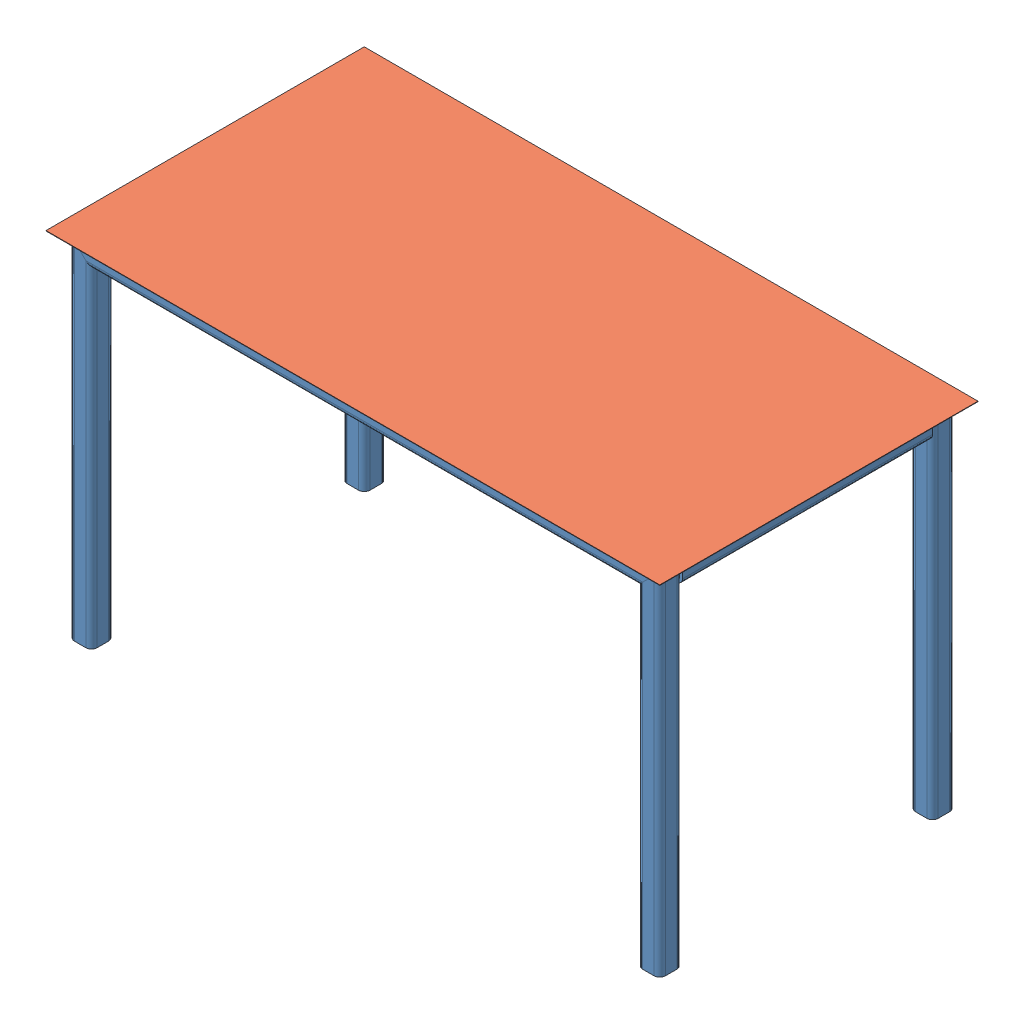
SolidWorks assembly c03_tut_02.SLDASM, configuration Default (file format 11000). Lengths in mm.
Overall size (1371.6 788.4 711.2).
2 component instances, 2 part files, 3 mates.
Components (placement in the parent):
- Table legs-1: Table legs.SLDPRT [Default<As Machined>] at origin size (1320.8 787.4 660.4)
- Table Top-1: Table Top.SLDPRT [Default] at (635 788.4 -304.8) size (1371.6 1 711.2)
Mates (geometry in assembly coordinates):
- Coincident1: coincident: plane of assembly; plane of assembly; plane of Table legs-1 through (1270 787.4 12.7) normal (0 1 0); plane of Table Top-1 through (635 787.4 -304.8) normal (0 -1 0)
- Width1: width: plane of assembly; plane of assembly; plane of assembly; plane of assembly; plane of Table legs-1 through (1282.7 0 25.4) normal (0 0 1); plane of Table legs-1 through (1282.7 762 -635) normal (0 0 -1); plane of Table Top-1 through (-50.8 787.4 50.8) normal (0 0 1); plane of Table Top-1 through (-50.8 787.4 -660.4) normal (0 0 -1)
- Width2: width: plane of assembly; plane of assembly; plane of assembly; plane of assembly; plane of Table legs-1 through (1295.4 749.3 -609.6) normal (1 0 0); plane of Table legs-1 through (-25.4 774.7 -609.6) normal (-1 0 0); plane of Table Top-1 through (-50.8 787.4 50.8) normal (-1 0 0); plane of Table Top-1 through (1320.8 787.4 50.8) normal (1 0 0)
